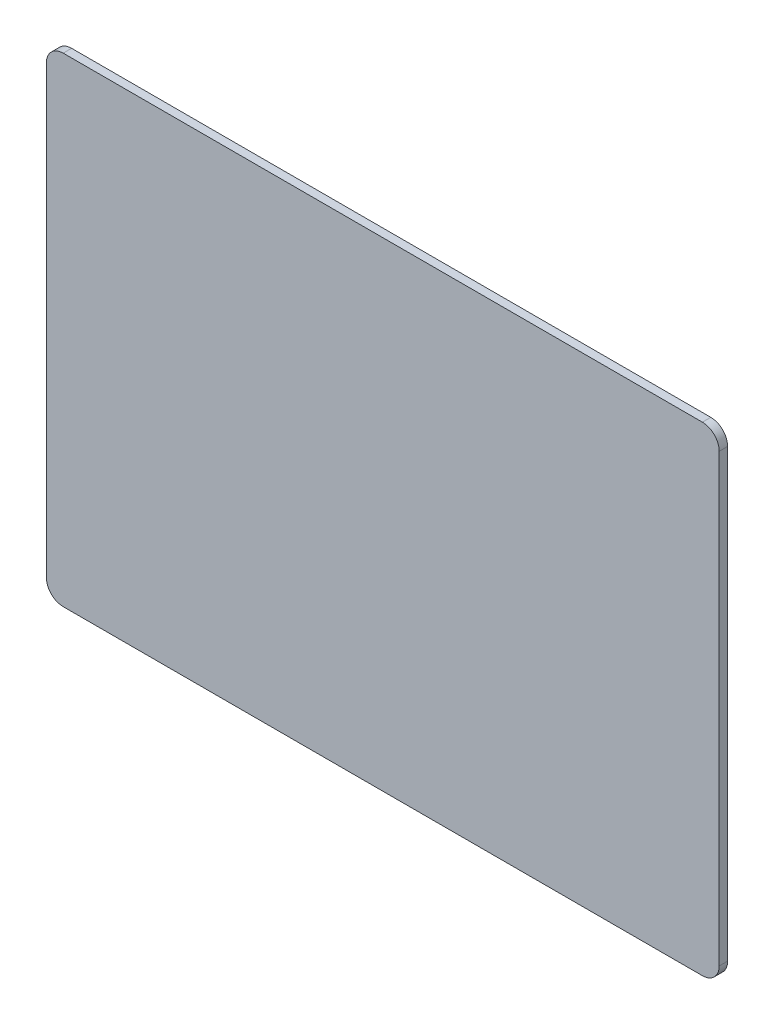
from build123d import *

# Parameters (mm, degrees)
ESQUISSE1_W             = 80
ESQUISSE1_H             = 57
BOSS_EXTRU_1_DEPTH      = 2
CONG_1_R                = 2
ESQUISSE2_OUTSIDE_W     = 101.684
ESQUISSE2_OUTSIDE_H     = 78.684
ESQUISSE2_OUTSIDE_W_2   = 74
ESQUISSE2_OUTSIDE_H_2   = 51
ENL_V_MAT_EXTRU_1_DEPTH = 1
ENL_V_MAT_EXTRU_1_DRAFT = 1


with BuildPart() as part:
    # Esquisse1 → Boss.-Extru.1 (new body)
    with BuildSketch(Plane.XY):
        with Locations((37, 25.5)):
            Rectangle(ESQUISSE1_W, ESQUISSE1_H)
    extrude(amount=BOSS_EXTRU_1_DEPTH)

    # Cong_1
    cong_1_edges = [part.edges().sort_by_distance(p)[0] for p in [
        (-3, 54, 1),
        (77, 54, 1),
        (77, -3, 1),
        (-3, -3, 1),
    ]]
    fillet(cong_1_edges, radius=CONG_1_R)


with BuildPart() as enl_v_mat_extru_1_tool:
    # Esquisse2 outside → Enl_v. mat.-Extru.1 (with draft: the straight prism first)
    with BuildSketch(Plane.XY):
        with Locations((37, 25.5)):
            Rectangle(ESQUISSE2_OUTSIDE_W, ESQUISSE2_OUTSIDE_H)
        with Locations((37, 25.5)):
            Rectangle(ESQUISSE2_OUTSIDE_W_2, ESQUISSE2_OUTSIDE_H_2, mode=Mode.SUBTRACT)
    extrude(amount=ENL_V_MAT_EXTRU_1_DEPTH)
    # Enl_v. mat.-Extru.1: the draft: its side faces are tilted about the plane it starts from
    enl_v_mat_extru_1_sides = [enl_v_mat_extru_1_tool.faces().sort_by_distance(p)[0] for p in [
        (37, -13.842, 0.5),
        (87.842, 25.5, 0.5),
        (37, 64.842, 0.5),
        (-13.842, 25.5, 0.5),
        (0, 25.5, 0.5),
        (37, 51, 0.5),
        (74, 25.5, 0.5),
        (37, 0, 0.5),
    ]]
    draft(enl_v_mat_extru_1_sides, Plane.XY, ENL_V_MAT_EXTRU_1_DRAFT)


with BuildPart() as part_1:
    add(part.part)

    # Enl_v. mat.-Extru.1: cut by enl_v_mat_extru_1_tool
    add(enl_v_mat_extru_1_tool.part, mode=Mode.SUBTRACT)


solid = part_1.part
